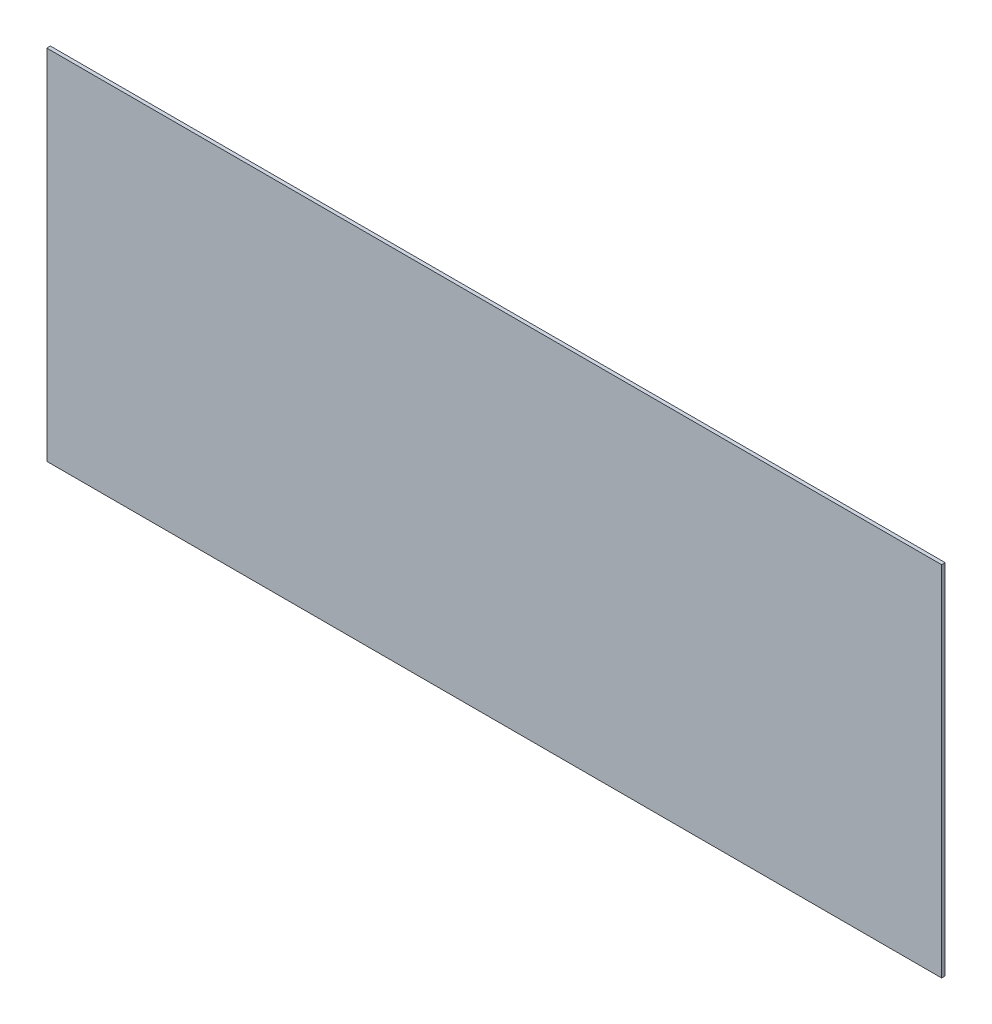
ISO-10303-21;
HEADER;
FILE_DESCRIPTION(('STEP AP214'),'2;1');
FILE_NAME('part.step','',(''),(''),'','','');
FILE_SCHEMA(('AUTOMOTIVE_DESIGN { 1 0 10303 214 1 1 1 1 }'));
ENDSEC;
DATA;
#1=APPLICATION_CONTEXT('core data for automotive mechanical design processes');
#2=APPLICATION_PROTOCOL_DEFINITION('international standard','automotive_design',2000,#1);
#3=PRODUCT_CONTEXT('',#1,'mechanical');
#4=PRODUCT('Part','Part','',(#3));
#5=PRODUCT_RELATED_PRODUCT_CATEGORY('part','',(#4));
#6=PRODUCT_DEFINITION_FORMATION('','',#4);
#7=PRODUCT_DEFINITION_CONTEXT('part definition',#1,'design');
#8=PRODUCT_DEFINITION('design','',#6,#7);
#9=PRODUCT_DEFINITION_SHAPE('','',#8);
#10=(LENGTH_UNIT() NAMED_UNIT(*) SI_UNIT(.MILLI.,.METRE.));
#11=(NAMED_UNIT(*) PLANE_ANGLE_UNIT() SI_UNIT($,.RADIAN.));
#12=(NAMED_UNIT(*) SI_UNIT($,.STERADIAN.) SOLID_ANGLE_UNIT());
#13=UNCERTAINTY_MEASURE_WITH_UNIT(LENGTH_MEASURE(1.E-05),#10,'distance_accuracy_value','');
#14=(GEOMETRIC_REPRESENTATION_CONTEXT(3) GLOBAL_UNCERTAINTY_ASSIGNED_CONTEXT((#13)) GLOBAL_UNIT_ASSIGNED_CONTEXT((#10,
#11,#12)) REPRESENTATION_CONTEXT('',''));
#15=CARTESIAN_POINT('',(0.,0.,0.));
#16=DIRECTION('',(0.,0.,1.));
#17=DIRECTION('',(1.,0.,0.));
#18=AXIS2_PLACEMENT_3D('',#15,#16,#17);
#19=CARTESIAN_POINT('',(125.,-50.,1.));
#20=DIRECTION('',(-1.,0.,0.));
#21=DIRECTION('',(0.,0.,1.));
#22=AXIS2_PLACEMENT_3D('',#19,#20,#21);
#23=PLANE('',#22);
#24=DIRECTION('',(0.,1.,0.));
#25=VECTOR('',#24,1.);
#26=CARTESIAN_POINT('',(125.,-50.,0.));
#27=LINE('',#26,#25);
#28=CARTESIAN_POINT('',(125.,-50.,0.));
#29=VERTEX_POINT('',#28);
#30=CARTESIAN_POINT('',(125.,50.,0.));
#31=VERTEX_POINT('',#30);
#32=EDGE_CURVE('E107',#29,#31,#27,.T.);
#33=ORIENTED_EDGE('',*,*,#32,.T.);
#34=DIRECTION('',(0.,0.,-1.));
#35=VECTOR('',#34,1.);
#36=CARTESIAN_POINT('',(125.,50.,1.));
#37=LINE('',#36,#35);
#38=CARTESIAN_POINT('',(125.,50.,1.));
#39=VERTEX_POINT('',#38);
#40=EDGE_CURVE('E11',#39,#31,#37,.T.);
#41=ORIENTED_EDGE('',*,*,#40,.F.);
#42=DIRECTION('',(0.,1.,0.));
#43=VECTOR('',#42,1.);
#44=CARTESIAN_POINT('',(125.,-50.,1.));
#45=LINE('',#44,#43);
#46=CARTESIAN_POINT('',(125.,-50.,1.));
#47=VERTEX_POINT('',#46);
#48=EDGE_CURVE('E91',#47,#39,#45,.T.);
#49=ORIENTED_EDGE('',*,*,#48,.F.);
#50=DIRECTION('',(0.,0.,-1.));
#51=VECTOR('',#50,1.);
#52=CARTESIAN_POINT('',(125.,-50.,1.));
#53=LINE('',#52,#51);
#54=EDGE_CURVE('E103',#47,#29,#53,.T.);
#55=ORIENTED_EDGE('',*,*,#54,.T.);
#56=EDGE_LOOP('',(#33,#41,#49,#55));
#57=FACE_BOUND('',#56,.T.);
#58=ADVANCED_FACE('F39',(#57),#23,.F.);
#59=CARTESIAN_POINT('',(-125.,50.,1.));
#60=DIRECTION('',(0.,-1.,0.));
#61=DIRECTION('',(0.,0.,-1.));
#62=AXIS2_PLACEMENT_3D('',#59,#60,#61);
#63=PLANE('',#62);
#64=DIRECTION('',(-1.,0.,0.));
#65=VECTOR('',#64,1.);
#66=CARTESIAN_POINT('',(-125.,50.,0.));
#67=LINE('',#66,#65);
#68=CARTESIAN_POINT('',(-125.,50.,0.));
#69=VERTEX_POINT('',#68);
#70=EDGE_CURVE('E96',#31,#69,#67,.T.);
#71=ORIENTED_EDGE('',*,*,#70,.T.);
#72=DIRECTION('',(0.,0.,-1.));
#73=VECTOR('',#72,1.);
#74=CARTESIAN_POINT('',(-125.,50.,1.));
#75=LINE('',#74,#73);
#76=CARTESIAN_POINT('',(-125.,50.,1.));
#77=VERTEX_POINT('',#76);
#78=EDGE_CURVE('E48',#77,#69,#75,.T.);
#79=ORIENTED_EDGE('',*,*,#78,.F.);
#80=DIRECTION('',(-1.,0.,0.));
#81=VECTOR('',#80,1.);
#82=CARTESIAN_POINT('',(-125.,50.,1.));
#83=LINE('',#82,#81);
#84=EDGE_CURVE('E86',#39,#77,#83,.T.);
#85=ORIENTED_EDGE('',*,*,#84,.F.);
#86=ORIENTED_EDGE('',*,*,#40,.T.);
#87=EDGE_LOOP('',(#71,#79,#85,#86));
#88=FACE_BOUND('',#87,.T.);
#89=ADVANCED_FACE('F95',(#88),#63,.F.);
#90=CARTESIAN_POINT('',(-125.,-50.,1.));
#91=DIRECTION('',(1.,0.,0.));
#92=DIRECTION('',(0.,0.,-1.));
#93=AXIS2_PLACEMENT_3D('',#90,#91,#92);
#94=PLANE('',#93);
#95=DIRECTION('',(0.,-1.,0.));
#96=VECTOR('',#95,1.);
#97=CARTESIAN_POINT('',(-125.,-50.,0.));
#98=LINE('',#97,#96);
#99=CARTESIAN_POINT('',(-125.,-50.,0.));
#100=VERTEX_POINT('',#99);
#101=EDGE_CURVE('E73',#69,#100,#98,.T.);
#102=ORIENTED_EDGE('',*,*,#101,.T.);
#103=DIRECTION('',(0.,0.,-1.));
#104=VECTOR('',#103,1.);
#105=CARTESIAN_POINT('',(-125.,-50.,1.));
#106=LINE('',#105,#104);
#107=CARTESIAN_POINT('',(-125.,-50.,1.));
#108=VERTEX_POINT('',#107);
#109=EDGE_CURVE('E98',#108,#100,#106,.T.);
#110=ORIENTED_EDGE('',*,*,#109,.F.);
#111=DIRECTION('',(0.,-1.,0.));
#112=VECTOR('',#111,1.);
#113=CARTESIAN_POINT('',(-125.,-50.,1.));
#114=LINE('',#113,#112);
#115=EDGE_CURVE('E89',#77,#108,#114,.T.);
#116=ORIENTED_EDGE('',*,*,#115,.F.);
#117=ORIENTED_EDGE('',*,*,#78,.T.);
#118=EDGE_LOOP('',(#102,#110,#116,#117));
#119=FACE_BOUND('',#118,.T.);
#120=ADVANCED_FACE('F99',(#119),#94,.F.);
#121=CARTESIAN_POINT('',(-125.,-50.,1.));
#122=DIRECTION('',(0.,1.,0.));
#123=DIRECTION('',(0.,0.,1.));
#124=AXIS2_PLACEMENT_3D('',#121,#122,#123);
#125=PLANE('',#124);
#126=DIRECTION('',(1.,0.,0.));
#127=VECTOR('',#126,1.);
#128=CARTESIAN_POINT('',(-125.,-50.,0.));
#129=LINE('',#128,#127);
#130=EDGE_CURVE('E79',#100,#29,#129,.T.);
#131=ORIENTED_EDGE('',*,*,#130,.T.);
#132=ORIENTED_EDGE('',*,*,#54,.F.);
#133=DIRECTION('',(1.,0.,0.));
#134=VECTOR('',#133,1.);
#135=CARTESIAN_POINT('',(-125.,-50.,1.));
#136=LINE('',#135,#134);
#137=EDGE_CURVE('E56',#108,#47,#136,.T.);
#138=ORIENTED_EDGE('',*,*,#137,.F.);
#139=ORIENTED_EDGE('',*,*,#109,.T.);
#140=EDGE_LOOP('',(#131,#132,#138,#139));
#141=FACE_BOUND('',#140,.T.);
#142=ADVANCED_FACE('F120',(#141),#125,.F.);
#143=CARTESIAN_POINT('',(0.,0.,1.));
#144=DIRECTION('',(0.,0.,-1.));
#145=DIRECTION('',(-1.,0.,0.));
#146=AXIS2_PLACEMENT_3D('',#143,#144,#145);
#147=PLANE('',#146);
#148=ORIENTED_EDGE('',*,*,#48,.T.);
#149=ORIENTED_EDGE('',*,*,#84,.T.);
#150=ORIENTED_EDGE('',*,*,#115,.T.);
#151=ORIENTED_EDGE('',*,*,#137,.T.);
#152=EDGE_LOOP('',(#148,#149,#150,#151));
#153=FACE_BOUND('',#152,.T.);
#154=ADVANCED_FACE('F87',(#153),#147,.F.);
#155=CARTESIAN_POINT('',(0.,0.,0.));
#156=DIRECTION('',(0.,0.,-1.));
#157=DIRECTION('',(-1.,0.,0.));
#158=AXIS2_PLACEMENT_3D('',#155,#156,#157);
#159=PLANE('',#158);
#160=ORIENTED_EDGE('',*,*,#32,.F.);
#161=ORIENTED_EDGE('',*,*,#130,.F.);
#162=ORIENTED_EDGE('',*,*,#101,.F.);
#163=ORIENTED_EDGE('',*,*,#70,.F.);
#164=EDGE_LOOP('',(#160,#161,#162,#163));
#165=FACE_BOUND('',#164,.T.);
#166=ADVANCED_FACE('F123',(#165),#159,.T.);
#167=CLOSED_SHELL('',(#58,#89,#120,#142,#154,#166));
#168=MANIFOLD_SOLID_BREP('B2',#167);
#169=ADVANCED_BREP_SHAPE_REPRESENTATION('',(#18,#168),#14);
#170=SHAPE_DEFINITION_REPRESENTATION(#9,#169);
ENDSEC;
END-ISO-10303-21;
